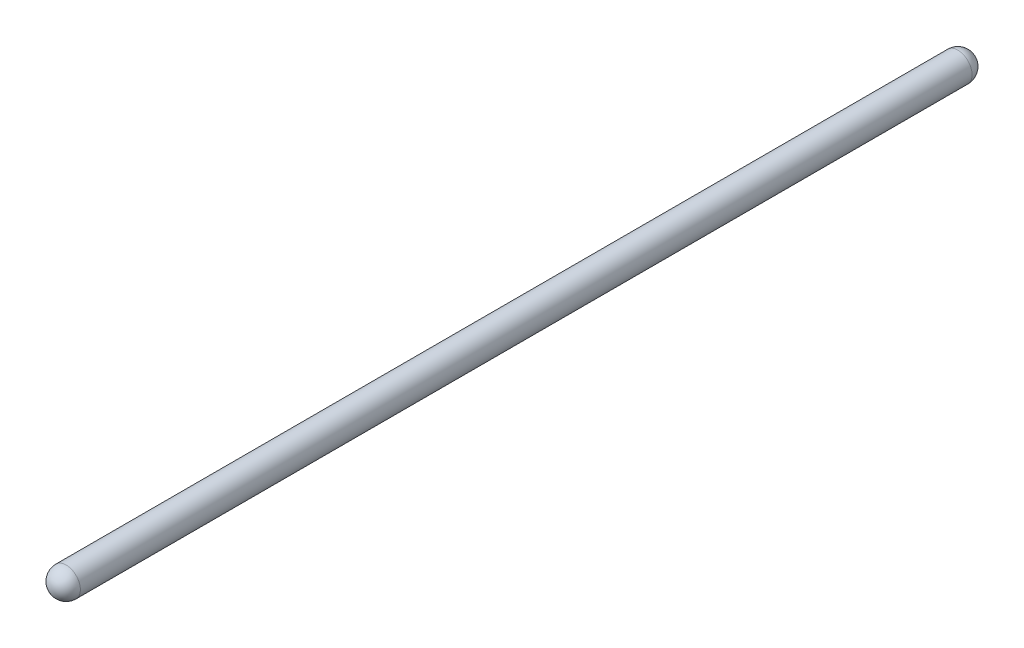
ISO-10303-21;
HEADER;
FILE_DESCRIPTION(('STEP AP214'),'2;1');
FILE_NAME('part.step','',(''),(''),'','','');
FILE_SCHEMA(('AUTOMOTIVE_DESIGN { 1 0 10303 214 1 1 1 1 }'));
ENDSEC;
DATA;
#1=APPLICATION_CONTEXT('core data for automotive mechanical design processes');
#2=APPLICATION_PROTOCOL_DEFINITION('international standard','automotive_design',2000,#1);
#3=PRODUCT_CONTEXT('',#1,'mechanical');
#4=PRODUCT('Part','Part','',(#3));
#5=PRODUCT_RELATED_PRODUCT_CATEGORY('part','',(#4));
#6=PRODUCT_DEFINITION_FORMATION('','',#4);
#7=PRODUCT_DEFINITION_CONTEXT('part definition',#1,'design');
#8=PRODUCT_DEFINITION('design','',#6,#7);
#9=PRODUCT_DEFINITION_SHAPE('','',#8);
#10=(LENGTH_UNIT() NAMED_UNIT(*) SI_UNIT(.MILLI.,.METRE.));
#11=(NAMED_UNIT(*) PLANE_ANGLE_UNIT() SI_UNIT($,.RADIAN.));
#12=(NAMED_UNIT(*) SI_UNIT($,.STERADIAN.) SOLID_ANGLE_UNIT());
#13=UNCERTAINTY_MEASURE_WITH_UNIT(LENGTH_MEASURE(1.E-05),#10,'distance_accuracy_value','');
#14=(GEOMETRIC_REPRESENTATION_CONTEXT(3) GLOBAL_UNCERTAINTY_ASSIGNED_CONTEXT((#13)) GLOBAL_UNIT_ASSIGNED_CONTEXT((#10,
#11,#12)) REPRESENTATION_CONTEXT('',''));
#15=CARTESIAN_POINT('',(0.,0.,0.));
#16=DIRECTION('',(0.,0.,1.));
#17=DIRECTION('',(1.,0.,0.));
#18=AXIS2_PLACEMENT_3D('',#15,#16,#17);
#19=CARTESIAN_POINT('',(0.,0.,64.5));
#20=DIRECTION('',(0.,0.,-1.));
#21=DIRECTION('',(-1.,0.,0.));
#22=AXIS2_PLACEMENT_3D('',#19,#20,#21);
#23=CYLINDRICAL_SURFACE('',#22,1.);
#24=CARTESIAN_POINT('',(0.,0.,1.));
#25=DIRECTION('',(0.,0.,-1.));
#26=DIRECTION('',(-1.,0.,0.));
#27=AXIS2_PLACEMENT_3D('',#24,#25,#26);
#28=CIRCLE('',#27,1.);
#29=CARTESIAN_POINT('',(-1.,0.,1.));
#30=VERTEX_POINT('',#29);
#31=EDGE_CURVE('E10',#30,#30,#28,.F.);
#32=ORIENTED_EDGE('',*,*,#31,.T.);
#33=EDGE_LOOP('',(#32));
#34=FACE_BOUND('',#33,.T.);
#35=CARTESIAN_POINT('',(0.,0.,63.5));
#36=DIRECTION('',(0.,0.,-1.));
#37=DIRECTION('',(-1.,0.,0.));
#38=AXIS2_PLACEMENT_3D('',#35,#36,#37);
#39=CIRCLE('',#38,1.);
#40=CARTESIAN_POINT('',(-1.,0.,63.5));
#41=VERTEX_POINT('',#40);
#42=EDGE_CURVE('E38',#41,#41,#39,.T.);
#43=ORIENTED_EDGE('',*,*,#42,.T.);
#44=EDGE_LOOP('',(#43));
#45=FACE_BOUND('',#44,.T.);
#46=ADVANCED_FACE('F31',(#34,#45),#23,.T.);
#47=CARTESIAN_POINT('',(0.,0.,1.));
#48=DIRECTION('',(0.,0.,1.));
#49=DIRECTION('',(1.,0.,0.));
#50=AXIS2_PLACEMENT_3D('',#47,#48,#49);
#51=SPHERICAL_SURFACE('',#50,1.);
#52=ORIENTED_EDGE('',*,*,#31,.F.);
#53=EDGE_LOOP('',(#52));
#54=FACE_BOUND('',#53,.T.);
#55=ADVANCED_FACE('F46',(#54),#51,.T.);
#56=CARTESIAN_POINT('',(0.,0.,63.5));
#57=DIRECTION('',(0.,0.,1.));
#58=DIRECTION('',(1.,0.,0.));
#59=AXIS2_PLACEMENT_3D('',#56,#57,#58);
#60=SPHERICAL_SURFACE('',#59,1.);
#61=ORIENTED_EDGE('',*,*,#42,.F.);
#62=EDGE_LOOP('',(#61));
#63=FACE_BOUND('',#62,.T.);
#64=ADVANCED_FACE('F33',(#63),#60,.T.);
#65=CLOSED_SHELL('',(#46,#55,#64));
#66=MANIFOLD_SOLID_BREP('B2',#65);
#67=ADVANCED_BREP_SHAPE_REPRESENTATION('',(#18,#66),#14);
#68=SHAPE_DEFINITION_REPRESENTATION(#9,#67);
ENDSEC;
END-ISO-10303-21;
